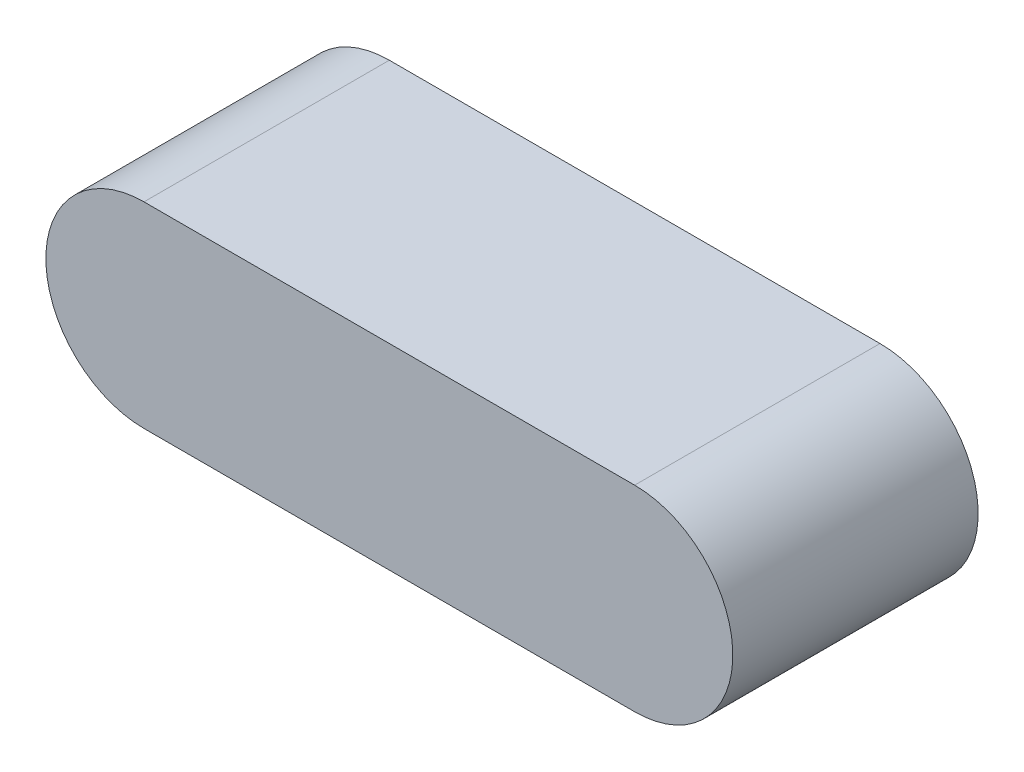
from build123d import *

# Parameters (mm, degrees)
EXTRUDE_1_DEPTH = 1


with BuildPart() as part:
    # Sketch 1 → Extrude 1 (new, symmetric)
    with BuildSketch(Plane.XY):
        with BuildLine():
            Line((2, -0.8), (-2, -0.8))
            ThreePointArc((-2, -0.8), (-2.8, 0), (-2, 0.8))
            Line((-2, 0.8), (2, 0.8))
            ThreePointArc((2, 0.8), (2.8, 0), (2, -0.8))
        make_face()
    extrude(amount=EXTRUDE_1_DEPTH, both=True)


solid = part.part
